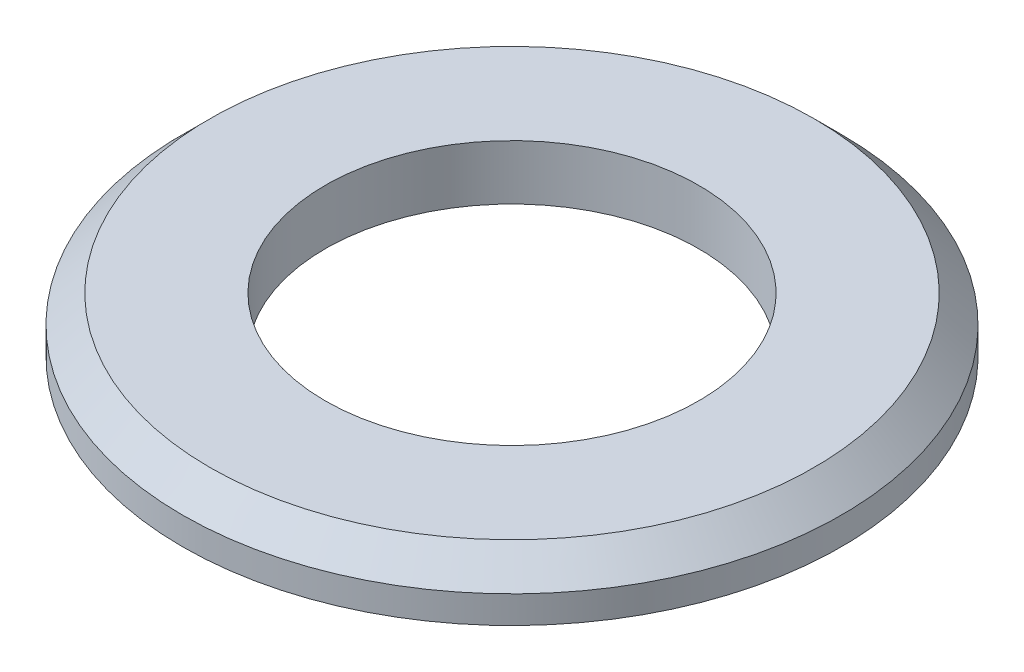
from build123d import *

# Parameters (mm, degrees)
SKETCH1_R      = 30
SKETCH1_R_2    = 17
EXTRUDE1_DEPTH = 5
CHAMFER1_SIZE  = 2.5


with BuildPart() as part:
    # Sketch1 → Extrude1 (new body)
    with BuildSketch(Plane(origin=(0, 0, 0), x_dir=(1, 0, 0), z_dir=(0, 1, 0))):
        with Locations(Location((0, 0, 0), (0, 0, 270))):
            Circle(SKETCH1_R)
        with Locations(Location((0, 0, 0), (0, 0, 270))):
            Circle(SKETCH1_R_2, mode=Mode.SUBTRACT)
    extrude(amount=EXTRUDE1_DEPTH)

    # Chamfer1
    chamfer1_edges = [part.edges().sort_by_distance(p)[0] for p in [
        (0, 5, -30),
    ]]
    chamfer(chamfer1_edges, length=CHAMFER1_SIZE)


solid = part.part
